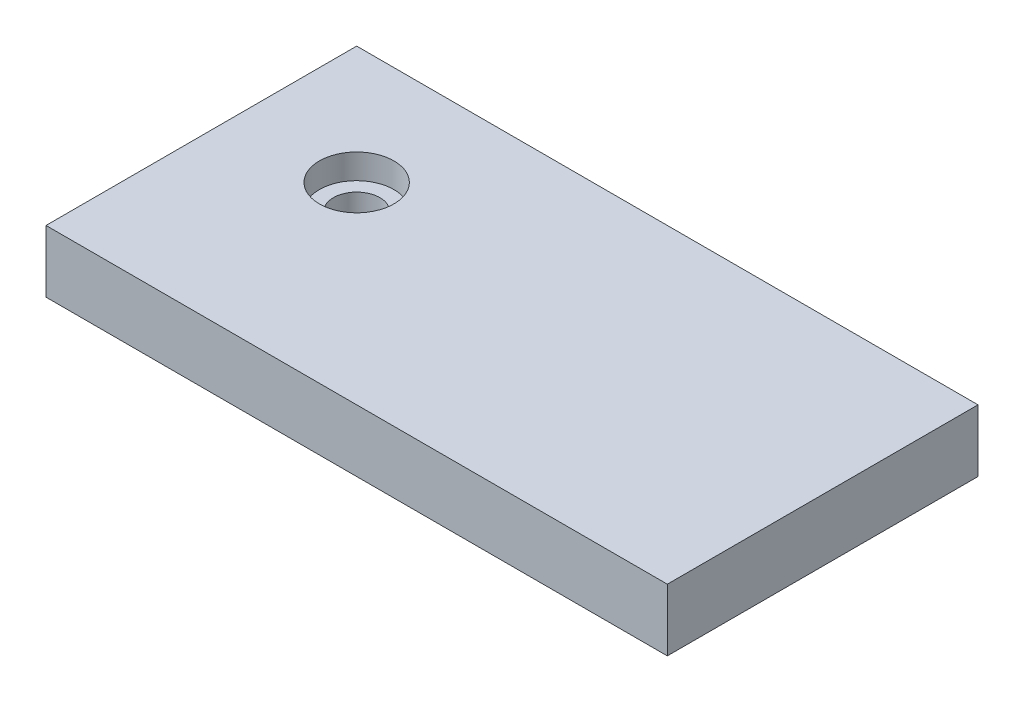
from build123d import *

# Parameters (mm, degrees)
SKETCH1_W                       = 100
SKETCH1_H                       = 50
EXTRUDE1_DEPTH                  = 10
CBORE_FOR_M3_SBHCS1_D           = 7.5
CBORE_FOR_M3_SBHCS1_CBORE_D     = 12
CBORE_FOR_M3_SBHCS1_CBORE_DEPTH = 4


with BuildPart() as part:
    # Sketch1 → Extrude1 (new body)
    with BuildSketch(Plane(origin=(0, 0, 0), x_dir=(1, 0, 0), z_dir=(0, 1, 0))):
        with Locations((50, 25)):
            Rectangle(SKETCH1_W, SKETCH1_H)
    extrude(amount=EXTRUDE1_DEPTH)

    # CBORE for M3 SBHCS1 (through all)
    with Locations(Plane(origin=(19, 10, -31), x_dir=(0, 0, 1), z_dir=(0, 1, 0))):
        with Locations((0, 0)):
            CounterBoreHole(CBORE_FOR_M3_SBHCS1_D / 2, CBORE_FOR_M3_SBHCS1_CBORE_D / 2, CBORE_FOR_M3_SBHCS1_CBORE_DEPTH)


solid = part.part
